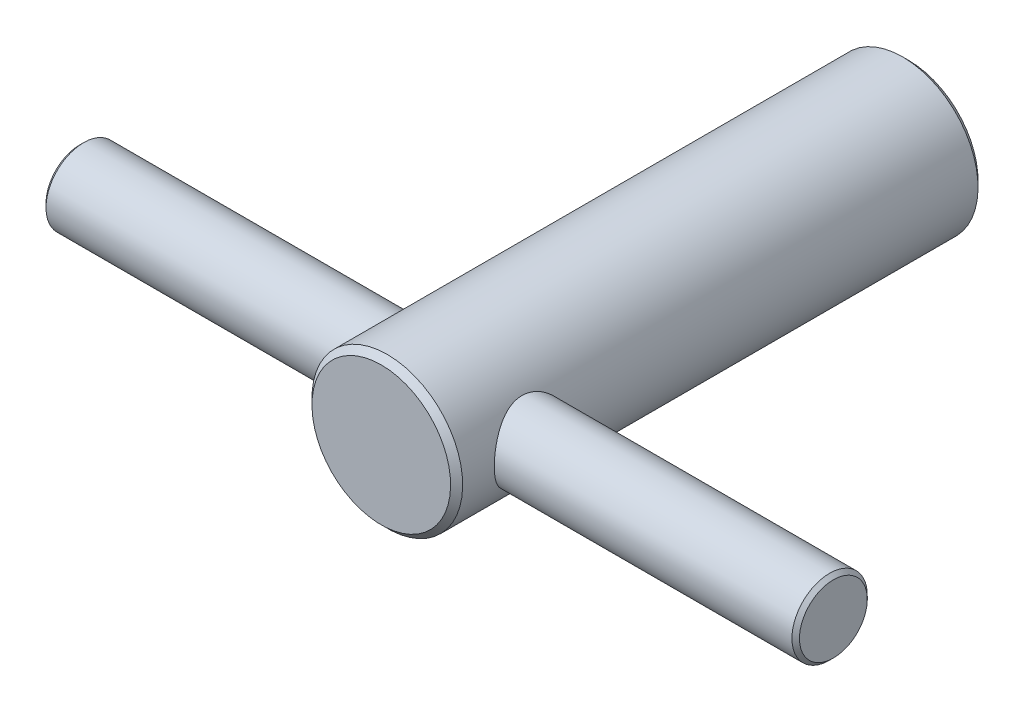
ISO-10303-21;
HEADER;
FILE_DESCRIPTION(('STEP AP214'),'2;1');
FILE_NAME('part.step','',(''),(''),'','','');
FILE_SCHEMA(('AUTOMOTIVE_DESIGN { 1 0 10303 214 1 1 1 1 }'));
ENDSEC;
DATA;
#1=APPLICATION_CONTEXT('core data for automotive mechanical design processes');
#2=APPLICATION_PROTOCOL_DEFINITION('international standard','automotive_design',2000,#1);
#3=PRODUCT_CONTEXT('',#1,'mechanical');
#4=PRODUCT('Part','Part','',(#3));
#5=PRODUCT_RELATED_PRODUCT_CATEGORY('part','',(#4));
#6=PRODUCT_DEFINITION_FORMATION('','',#4);
#7=PRODUCT_DEFINITION_CONTEXT('part definition',#1,'design');
#8=PRODUCT_DEFINITION('design','',#6,#7);
#9=PRODUCT_DEFINITION_SHAPE('','',#8);
#10=(LENGTH_UNIT() NAMED_UNIT(*) SI_UNIT(.MILLI.,.METRE.));
#11=(NAMED_UNIT(*) PLANE_ANGLE_UNIT() SI_UNIT($,.RADIAN.));
#12=(NAMED_UNIT(*) SI_UNIT($,.STERADIAN.) SOLID_ANGLE_UNIT());
#13=UNCERTAINTY_MEASURE_WITH_UNIT(LENGTH_MEASURE(1.E-05),#10,'distance_accuracy_value','');
#14=(GEOMETRIC_REPRESENTATION_CONTEXT(3) GLOBAL_UNCERTAINTY_ASSIGNED_CONTEXT((#13)) GLOBAL_UNIT_ASSIGNED_CONTEXT((#10,
#11,#12)) REPRESENTATION_CONTEXT('',''));
#15=CARTESIAN_POINT('',(0.,0.,0.));
#16=DIRECTION('',(0.,0.,1.));
#17=DIRECTION('',(1.,0.,0.));
#18=AXIS2_PLACEMENT_3D('',#15,#16,#17);
#19=CARTESIAN_POINT('',(0.,0.,0.));
#20=DIRECTION('',(0.,0.,-1.));
#21=DIRECTION('',(0.,1.,0.));
#22=AXIS2_PLACEMENT_3D('',#19,#20,#21);
#23=CYLINDRICAL_SURFACE('',#22,10.);
#24=CARTESIAN_POINT('',(0.,0.,0.8));
#25=DIRECTION('',(0.,0.,-1.));
#26=DIRECTION('',(0.,1.,0.));
#27=AXIS2_PLACEMENT_3D('',#24,#25,#26);
#28=CIRCLE('',#27,10.);
#29=CARTESIAN_POINT('',(0.,10.,0.8));
#30=VERTEX_POINT('',#29);
#31=EDGE_CURVE('E87',#30,#30,#28,.T.);
#32=ORIENTED_EDGE('',*,*,#31,.F.);
#33=EDGE_LOOP('',(#32));
#34=FACE_BOUND('',#33,.T.);
#35=CARTESIAN_POINT('',(8.66025403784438,5.,60.));
#36=CARTESIAN_POINT('',(8.66025482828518,4.99999937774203,60.1303316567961));
#37=CARTESIAN_POINT('',(8.66320639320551,4.99489703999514,60.2606749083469));
#38=CARTESIAN_POINT('',(8.67490215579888,4.97455590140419,60.5203552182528));
#39=CARTESIAN_POINT('',(8.68364905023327,4.95931238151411,60.6496917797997));
#40=CARTESIAN_POINT('',(8.70662912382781,4.91885673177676,60.9065135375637));
#41=CARTESIAN_POINT('',(8.72087090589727,4.89362896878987,61.033995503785));
#42=CARTESIAN_POINT('',(8.75432466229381,4.83352579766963,61.2860174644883));
#43=CARTESIAN_POINT('',(8.77353879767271,4.79864619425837,61.410556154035));
#44=CARTESIAN_POINT('',(8.83745677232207,4.68053466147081,61.7771112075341));
#45=CARTESIAN_POINT('',(8.88859880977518,4.58356144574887,62.0137323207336));
#46=CARTESIAN_POINT('',(9.00213659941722,4.35632594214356,62.4671619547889));
#47=CARTESIAN_POINT('',(9.06453296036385,4.22606185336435,62.6839694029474));
#48=CARTESIAN_POINT('',(9.19984032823,3.92334549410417,63.1115106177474));
#49=CARTESIAN_POINT('',(9.27319410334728,3.74829976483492,63.3202685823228));
#50=CARTESIAN_POINT('',(9.41860822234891,3.36622943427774,63.7070690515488));
#51=CARTESIAN_POINT('',(9.49066790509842,3.15918897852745,63.8850962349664));
#52=CARTESIAN_POINT('',(9.59484443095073,2.82033206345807,64.1312264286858));
#53=CARTESIAN_POINT('',(9.62993554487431,2.69838192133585,64.2119131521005));
#54=CARTESIAN_POINT('',(9.69680156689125,2.44722131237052,64.3626286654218));
#55=CARTESIAN_POINT('',(9.72857779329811,2.31801376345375,64.4326616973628));
#56=CARTESIAN_POINT('',(9.78789520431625,2.05317391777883,64.5613762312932));
#57=CARTESIAN_POINT('',(9.81543747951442,1.91754328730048,64.6200606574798));
#58=CARTESIAN_POINT('',(9.86547242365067,1.64079696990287,64.7254310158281));
#59=CARTESIAN_POINT('',(9.88796562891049,1.49968186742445,64.7721182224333));
#60=CARTESIAN_POINT('',(9.92580359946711,1.2233043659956,64.8500155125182));
#61=CARTESIAN_POINT('',(9.94154295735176,1.08833937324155,64.8820901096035));
#62=CARTESIAN_POINT('',(9.96761571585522,0.815709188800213,64.9349664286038));
#63=CARTESIAN_POINT('',(9.97794964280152,0.67804426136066,64.9557692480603));
#64=CARTESIAN_POINT('',(9.99290900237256,0.401217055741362,64.9858199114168));
#65=CARTESIAN_POINT('',(9.99753719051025,0.262055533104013,64.9950733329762));
#66=CARTESIAN_POINT('',(10.0009568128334,-0.0166220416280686,65.0019143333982));
#67=CARTESIAN_POINT('',(9.99974860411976,-0.156138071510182,64.9995026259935));
#68=CARTESIAN_POINT('',(9.99189263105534,-0.422158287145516,64.9837693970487));
#69=CARTESIAN_POINT('',(9.9857287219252,-0.548735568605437,64.9714182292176));
#70=CARTESIAN_POINT('',(9.9687211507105,-0.800312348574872,64.937167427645));
#71=CARTESIAN_POINT('',(9.95787601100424,-0.92531133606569,64.915264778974));
#72=CARTESIAN_POINT('',(9.93176736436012,-1.17280363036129,64.8621537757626));
#73=CARTESIAN_POINT('',(9.91650533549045,-1.29529776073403,64.8309485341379));
#74=CARTESIAN_POINT('',(9.88192155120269,-1.53706747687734,64.7595523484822));
#75=CARTESIAN_POINT('',(9.86259824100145,-1.6563418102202,64.7193579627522));
#76=CARTESIAN_POINT('',(9.79859222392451,-2.01140340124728,64.5846254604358));
#77=CARTESIAN_POINT('',(9.74822622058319,-2.24122720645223,64.4766310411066));
#78=CARTESIAN_POINT('',(9.63687815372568,-2.67992393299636,64.2286703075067));
#79=CARTESIAN_POINT('',(9.57589229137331,-2.88878931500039,64.088692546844));
#80=CARTESIAN_POINT('',(9.44222356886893,-3.30085071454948,63.7655365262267));
#81=CARTESIAN_POINT('',(9.36897995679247,-3.50164452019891,63.5795253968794));
#82=CARTESIAN_POINT('',(9.22270586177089,-3.87054772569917,63.1770108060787));
#83=CARTESIAN_POINT('',(9.14967558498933,-4.03863197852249,62.9604841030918));
#84=CARTESIAN_POINT('',(9.04390911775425,-4.26795395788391,62.6088064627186));
#85=CARTESIAN_POINT('',(9.00829977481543,-4.34240098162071,62.4829490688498));
#86=CARTESIAN_POINT('',(8.94051483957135,-4.48030007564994,62.2244861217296));
#87=CARTESIAN_POINT('',(8.90833780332,-4.54375677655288,62.0918834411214));
#88=CARTESIAN_POINT('',(8.84860631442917,-4.65901104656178,61.8207965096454));
#89=CARTESIAN_POINT('',(8.82104906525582,-4.71081567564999,61.6823158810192));
#90=CARTESIAN_POINT('',(8.7716484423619,-4.80217514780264,61.4003786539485));
#91=CARTESIAN_POINT('',(8.74980428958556,-4.84173166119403,61.2569227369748));
#92=CARTESIAN_POINT('',(8.71426171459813,-4.90539138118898,60.9777430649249));
#93=CARTESIAN_POINT('',(8.7000553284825,-4.93047005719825,60.8423062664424));
#94=CARTESIAN_POINT('',(8.67788216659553,-4.96939299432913,60.5693280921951));
#95=CARTESIAN_POINT('',(8.66991462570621,-4.98323863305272,60.4317869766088));
#96=CARTESIAN_POINT('',(8.66056020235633,-4.99947854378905,60.1558845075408));
#97=CARTESIAN_POINT('',(8.65916956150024,-5.0018793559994,60.01752366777));
#98=CARTESIAN_POINT('',(8.66301922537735,-4.99520900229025,59.7411790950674));
#99=CARTESIAN_POINT('',(8.66825908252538,-4.98613861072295,59.6031953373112));
#100=CARTESIAN_POINT('',(8.68421505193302,-4.9582892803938,59.3439119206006));
#101=CARTESIAN_POINT('',(8.69426699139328,-4.94068517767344,59.2224432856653));
#102=CARTESIAN_POINT('',(8.71910498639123,-4.8967167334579,58.9815824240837));
#103=CARTESIAN_POINT('',(8.73389250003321,-4.87034969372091,58.8621908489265));
#104=CARTESIAN_POINT('',(8.7846960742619,-4.77850297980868,58.5082899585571));
#105=CARTESIAN_POINT('',(8.82716454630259,-4.7002591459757,58.2778857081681));
#106=CARTESIAN_POINT('',(8.92681241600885,-4.50823244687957,57.8229067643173));
#107=CARTESIAN_POINT('',(8.98458205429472,-4.392971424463,57.5990963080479));
#108=CARTESIAN_POINT('',(9.10780608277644,-4.13143421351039,57.1726622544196));
#109=CARTESIAN_POINT('',(9.1732644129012,-3.9851420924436,56.9700496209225));
#110=CARTESIAN_POINT('',(9.31439795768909,-3.64419701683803,56.5651085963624));
#111=CARTESIAN_POINT('',(9.39032093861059,-3.44577250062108,56.3660355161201));
#112=CARTESIAN_POINT('',(9.53671997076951,-3.01697632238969,56.0029175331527));
#113=CARTESIAN_POINT('',(9.60719417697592,-2.78659391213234,55.8388844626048));
#114=CARTESIAN_POINT('',(9.70419418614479,-2.41774074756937,55.6209905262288));
#115=CARTESIAN_POINT('',(9.73542921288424,-2.28903769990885,55.5523379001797));
#116=CARTESIAN_POINT('',(9.79367711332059,-2.02535752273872,55.426243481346));
#117=CARTESIAN_POINT('',(9.82069185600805,-1.89038320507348,55.3687967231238));
#118=CARTESIAN_POINT('',(9.86968940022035,-1.61516754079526,55.2657820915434));
#119=CARTESIAN_POINT('',(9.89167460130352,-1.47492874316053,55.2202085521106));
#120=CARTESIAN_POINT('',(9.92995088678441,-1.19024723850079,55.1414909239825));
#121=CARTESIAN_POINT('',(9.94624264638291,-1.04580503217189,55.1083453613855));
#122=CARTESIAN_POINT('',(9.97139931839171,-0.767401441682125,55.0574049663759));
#123=CARTESIAN_POINT('',(9.98080865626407,-0.633694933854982,55.0384803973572));
#124=CARTESIAN_POINT('',(9.99424478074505,-0.364924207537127,55.0115065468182));
#125=CARTESIAN_POINT('',(9.9982719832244,-0.229860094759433,55.0034564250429));
#126=CARTESIAN_POINT('',(10.0008314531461,0.0404881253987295,54.9983368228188));
#127=CARTESIAN_POINT('',(9.999365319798,0.175772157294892,55.0012641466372));
#128=CARTESIAN_POINT('',(9.99098333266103,0.445485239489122,55.0180525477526));
#129=CARTESIAN_POINT('',(9.98406762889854,0.579914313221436,55.0319133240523));
#130=CARTESIAN_POINT('',(9.96560870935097,0.838004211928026,55.0691176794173));
#131=CARTESIAN_POINT('',(9.95440210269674,0.961788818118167,55.0917728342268));
#132=CARTESIAN_POINT('',(9.92767317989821,1.20687032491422,55.1462131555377));
#133=CARTESIAN_POINT('',(9.91214948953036,1.32816642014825,55.1780012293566));
#134=CARTESIAN_POINT('',(9.859612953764,1.68709586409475,55.2866082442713));
#135=CARTESIAN_POINT('',(9.81661817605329,1.91998814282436,55.3767019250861));
#136=CARTESIAN_POINT('',(9.71629432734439,2.37715486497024,55.5936422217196));
#137=CARTESIAN_POINT('',(9.65843082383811,2.60063468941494,55.7218959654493));
#138=CARTESIAN_POINT('',(9.53440669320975,3.02386422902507,56.0097903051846));
#139=CARTESIAN_POINT('',(9.46824226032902,3.22360297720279,56.1694453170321));
#140=CARTESIAN_POINT('',(9.32643278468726,3.61456788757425,56.5339751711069));
#141=CARTESIAN_POINT('',(9.25049954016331,3.80296860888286,56.7417690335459));
#142=CARTESIAN_POINT('',(9.10314421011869,4.14333626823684,57.1872970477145));
#143=CARTESIAN_POINT('',(9.03172615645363,4.29527097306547,57.4250574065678));
#144=CARTESIAN_POINT('',(8.93341291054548,4.49442606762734,57.8042196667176));
#145=CARTESIAN_POINT('',(8.90168698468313,4.55675683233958,57.936626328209));
#146=CARTESIAN_POINT('',(8.84287972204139,4.6698542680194,58.2072554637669));
#147=CARTESIAN_POINT('',(8.81579599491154,4.7206268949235,58.3454748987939));
#148=CARTESIAN_POINT('',(8.76742025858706,4.80987708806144,58.6264078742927));
#149=CARTESIAN_POINT('',(8.74611337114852,4.8483862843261,58.7691087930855));
#150=CARTESIAN_POINT('',(8.71014784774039,4.91270711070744,59.0580921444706));
#151=CARTESIAN_POINT('',(8.69548456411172,4.93852761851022,59.2043719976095));
#152=CARTESIAN_POINT('',(8.67647541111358,4.97182308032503,59.4589978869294));
#153=CARTESIAN_POINT('',(8.67040719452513,4.98237929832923,59.5668242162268));
#154=CARTESIAN_POINT('',(8.66229604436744,4.99646825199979,59.7830976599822));
#155=CARTESIAN_POINT('',(8.66025338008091,5.00000051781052,59.8915448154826));
#156=CARTESIAN_POINT('',(8.66025403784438,5.,60.));
#157=B_SPLINE_CURVE_WITH_KNOTS('',3,(#35,#36,#37,#38,#39,#40,#41,#42,#43,#44,#45,#46,#47,#48,
#49,#50,#51,#52,#53,#54,#55,#56,#57,#58,#59,#60,#61,#62,#63,#64,#65,#66,#67,#68,#69,#70,#71,#72,
#73,#74,#75,#76,#77,#78,#79,#80,#81,#82,#83,#84,#85,#86,#87,#88,#89,#90,#91,#92,#93,#94,#95,#96,
#97,#98,#99,#100,#101,#102,#103,#104,#105,#106,#107,#108,#109,#110,#111,#112,#113,#114,#115,
#116,#117,#118,#119,#120,#121,#122,#123,#124,#125,#126,#127,#128,#129,#130,#131,#132,#133,#134,
#135,#136,#137,#138,#139,#140,#141,#142,#143,#144,#145,#146,#147,#148,#149,#150,#151,#152,#153,
#154,#155,#156),.UNSPECIFIED.,.T.,.F.,(4,2,2,2,2,2,2,2,2,2,2,2,2,2,2,2,2,2,2,2,2,2,2,2,2,2,2,2,
2,2,2,2,2,2,2,2,2,2,2,2,2,2,2,2,2,2,2,2,2,2,2,2,2,2,2,2,2,2,2,2,4),(0.,0.390882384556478,
0.781946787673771,1.17362595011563,1.56547562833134,2.34415414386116,3.12287479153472,
3.96582272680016,4.80918971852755,5.25982992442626,5.71029022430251,6.16063429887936,
6.61093051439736,7.02920538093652,7.44743951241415,7.86547158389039,8.28347807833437,
8.66500933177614,9.0466611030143,9.42818530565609,9.80985583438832,10.5829669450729,
11.3563551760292,12.2028497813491,13.0499926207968,13.501002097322,13.9518210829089,
14.4023661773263,14.8528498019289,15.2676702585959,15.6824398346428,16.0969723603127,
16.5114769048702,16.8804871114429,17.2496110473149,17.9873544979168,18.759266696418,
19.5315761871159,20.4012390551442,21.2711951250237,21.7182117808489,22.1650299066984,
22.6116344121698,23.0581859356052,23.4637505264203,23.8692837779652,24.2746989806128,
24.6801030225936,25.0586722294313,25.4373620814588,26.1940875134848,26.9831783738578,
27.7726323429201,28.6406529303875,29.5094379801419,29.9581473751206,30.4066250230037,
30.8539364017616,31.3009343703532,31.626184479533,31.9514563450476),.UNSPECIFIED.);
#158=CARTESIAN_POINT('',(8.66025403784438,5.,60.));
#159=VERTEX_POINT('',#158);
#160=EDGE_CURVE('E27',#159,#159,#157,.T.);
#161=ORIENTED_EDGE('',*,*,#160,.F.);
#162=EDGE_LOOP('',(#161));
#163=FACE_BOUND('',#162,.T.);
#164=CARTESIAN_POINT('',(0.,0.,69.2));
#165=DIRECTION('',(0.,0.,-1.));
#166=DIRECTION('',(0.,1.,0.));
#167=AXIS2_PLACEMENT_3D('',#164,#165,#166);
#168=CIRCLE('',#167,10.);
#169=CARTESIAN_POINT('',(0.,10.,69.2));
#170=VERTEX_POINT('',#169);
#171=EDGE_CURVE('E94',#170,#170,#168,.T.);
#172=ORIENTED_EDGE('',*,*,#171,.T.);
#173=EDGE_LOOP('',(#172));
#174=FACE_BOUND('',#173,.T.);
#175=CARTESIAN_POINT('',(-8.66025403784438,5.,60.));
#176=CARTESIAN_POINT('',(-8.66025482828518,4.99999937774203,59.8696683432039));
#177=CARTESIAN_POINT('',(-8.66320639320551,4.99489703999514,59.7393250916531));
#178=CARTESIAN_POINT('',(-8.67490215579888,4.97455590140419,59.4796447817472));
#179=CARTESIAN_POINT('',(-8.68364905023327,4.95931238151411,59.3503082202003));
#180=CARTESIAN_POINT('',(-8.70662912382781,4.91885673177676,59.0934864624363));
#181=CARTESIAN_POINT('',(-8.72087090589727,4.89362896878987,58.966004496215));
#182=CARTESIAN_POINT('',(-8.75432466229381,4.83352579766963,58.7139825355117));
#183=CARTESIAN_POINT('',(-8.77353879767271,4.79864619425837,58.589443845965));
#184=CARTESIAN_POINT('',(-8.83745677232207,4.68053466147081,58.2228887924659));
#185=CARTESIAN_POINT('',(-8.88859880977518,4.58356144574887,57.9862676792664));
#186=CARTESIAN_POINT('',(-9.00213659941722,4.35632594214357,57.5328380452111));
#187=CARTESIAN_POINT('',(-9.06453296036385,4.22606185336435,57.3160305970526));
#188=CARTESIAN_POINT('',(-9.19984032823,3.92334549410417,56.8884893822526));
#189=CARTESIAN_POINT('',(-9.27319410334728,3.74829976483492,56.6797314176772));
#190=CARTESIAN_POINT('',(-9.41860822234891,3.36622943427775,56.2929309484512));
#191=CARTESIAN_POINT('',(-9.49066790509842,3.15918897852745,56.1149037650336));
#192=CARTESIAN_POINT('',(-9.59484443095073,2.82033206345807,55.8687735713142));
#193=CARTESIAN_POINT('',(-9.62993554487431,2.69838192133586,55.7880868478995));
#194=CARTESIAN_POINT('',(-9.69680156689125,2.44722131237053,55.6373713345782));
#195=CARTESIAN_POINT('',(-9.72857779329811,2.31801376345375,55.5673383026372));
#196=CARTESIAN_POINT('',(-9.78789520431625,2.05317391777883,55.4386237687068));
#197=CARTESIAN_POINT('',(-9.81543747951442,1.91754328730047,55.3799393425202));
#198=CARTESIAN_POINT('',(-9.86547242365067,1.64079696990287,55.2745689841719));
#199=CARTESIAN_POINT('',(-9.88796562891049,1.49968186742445,55.2278817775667));
#200=CARTESIAN_POINT('',(-9.92580359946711,1.2233043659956,55.1499844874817));
#201=CARTESIAN_POINT('',(-9.94154295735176,1.08833937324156,55.1179098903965));
#202=CARTESIAN_POINT('',(-9.96761571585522,0.815709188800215,55.0650335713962));
#203=CARTESIAN_POINT('',(-9.97794964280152,0.678044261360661,55.0442307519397));
#204=CARTESIAN_POINT('',(-9.99290900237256,0.401217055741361,55.0141800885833));
#205=CARTESIAN_POINT('',(-9.99753719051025,0.262055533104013,55.0049266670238));
#206=CARTESIAN_POINT('',(-10.0009568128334,-0.0166220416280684,54.9980856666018));
#207=CARTESIAN_POINT('',(-9.99974860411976,-0.156138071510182,55.0004973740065));
#208=CARTESIAN_POINT('',(-9.99189263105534,-0.422158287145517,55.0162306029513));
#209=CARTESIAN_POINT('',(-9.9857287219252,-0.548735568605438,55.0285817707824));
#210=CARTESIAN_POINT('',(-9.9687211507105,-0.800312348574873,55.0628325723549));
#211=CARTESIAN_POINT('',(-9.95787601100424,-0.925311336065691,55.084735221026));
#212=CARTESIAN_POINT('',(-9.93176736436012,-1.17280363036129,55.1378462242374));
#213=CARTESIAN_POINT('',(-9.91650533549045,-1.29529776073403,55.1690514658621));
#214=CARTESIAN_POINT('',(-9.88192155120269,-1.53706747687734,55.2404476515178));
#215=CARTESIAN_POINT('',(-9.86259824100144,-1.6563418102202,55.2806420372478));
#216=CARTESIAN_POINT('',(-9.79859222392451,-2.01140340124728,55.4153745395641));
#217=CARTESIAN_POINT('',(-9.74822622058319,-2.24122720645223,55.5233689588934));
#218=CARTESIAN_POINT('',(-9.63687815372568,-2.67992393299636,55.7713296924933));
#219=CARTESIAN_POINT('',(-9.57589229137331,-2.88878931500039,55.911307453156));
#220=CARTESIAN_POINT('',(-9.44222356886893,-3.30085071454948,56.2344634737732));
#221=CARTESIAN_POINT('',(-9.36897995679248,-3.50164452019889,56.4204746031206));
#222=CARTESIAN_POINT('',(-9.22270586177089,-3.87054772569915,56.8229891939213));
#223=CARTESIAN_POINT('',(-9.14967558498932,-4.03863197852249,57.0395158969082));
#224=CARTESIAN_POINT('',(-9.04390911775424,-4.26795395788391,57.3911935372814));
#225=CARTESIAN_POINT('',(-9.00829977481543,-4.34240098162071,57.5170509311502));
#226=CARTESIAN_POINT('',(-8.94051483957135,-4.48030007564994,57.7755138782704));
#227=CARTESIAN_POINT('',(-8.90833780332,-4.54375677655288,57.9081165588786));
#228=CARTESIAN_POINT('',(-8.84860631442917,-4.65901104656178,58.1792034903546));
#229=CARTESIAN_POINT('',(-8.82104906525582,-4.71081567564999,58.3176841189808));
#230=CARTESIAN_POINT('',(-8.7716484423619,-4.80217514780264,58.5996213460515));
#231=CARTESIAN_POINT('',(-8.74980428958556,-4.84173166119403,58.7430772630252));
#232=CARTESIAN_POINT('',(-8.71426171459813,-4.90539138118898,59.0222569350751));
#233=CARTESIAN_POINT('',(-8.7000553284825,-4.93047005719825,59.1576937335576));
#234=CARTESIAN_POINT('',(-8.67788216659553,-4.96939299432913,59.4306719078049));
#235=CARTESIAN_POINT('',(-8.66991462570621,-4.98323863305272,59.5682130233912));
#236=CARTESIAN_POINT('',(-8.66056020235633,-4.99947854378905,59.8441154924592));
#237=CARTESIAN_POINT('',(-8.65916956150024,-5.0018793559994,59.98247633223));
#238=CARTESIAN_POINT('',(-8.66301922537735,-4.99520900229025,60.2588209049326));
#239=CARTESIAN_POINT('',(-8.66825908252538,-4.98613861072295,60.3968046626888));
#240=CARTESIAN_POINT('',(-8.68421505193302,-4.9582892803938,60.6560880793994));
#241=CARTESIAN_POINT('',(-8.69426699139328,-4.94068517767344,60.7775567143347));
#242=CARTESIAN_POINT('',(-8.71910498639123,-4.8967167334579,61.0184175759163));
#243=CARTESIAN_POINT('',(-8.73389250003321,-4.87034969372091,61.1378091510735));
#244=CARTESIAN_POINT('',(-8.7846960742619,-4.77850297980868,61.4917100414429));
#245=CARTESIAN_POINT('',(-8.82716454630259,-4.70025914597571,61.7221142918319));
#246=CARTESIAN_POINT('',(-8.92681241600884,-4.50823244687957,62.1770932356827));
#247=CARTESIAN_POINT('',(-8.98458205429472,-4.392971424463,62.4009036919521));
#248=CARTESIAN_POINT('',(-9.10780608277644,-4.13143421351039,62.8273377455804));
#249=CARTESIAN_POINT('',(-9.1732644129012,-3.9851420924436,63.0299503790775));
#250=CARTESIAN_POINT('',(-9.31439795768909,-3.64419701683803,63.4348914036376));
#251=CARTESIAN_POINT('',(-9.39032093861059,-3.44577250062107,63.6339644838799));
#252=CARTESIAN_POINT('',(-9.53671997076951,-3.01697632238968,63.9970824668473));
#253=CARTESIAN_POINT('',(-9.60719417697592,-2.78659391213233,64.1611155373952));
#254=CARTESIAN_POINT('',(-9.70419418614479,-2.41774074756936,64.3790094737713));
#255=CARTESIAN_POINT('',(-9.73542921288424,-2.28903769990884,64.4476620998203));
#256=CARTESIAN_POINT('',(-9.79367711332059,-2.02535752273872,64.5737565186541));
#257=CARTESIAN_POINT('',(-9.82069185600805,-1.89038320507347,64.6312032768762));
#258=CARTESIAN_POINT('',(-9.86968940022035,-1.61516754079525,64.7342179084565));
#259=CARTESIAN_POINT('',(-9.89167460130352,-1.47492874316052,64.7797914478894));
#260=CARTESIAN_POINT('',(-9.92995088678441,-1.19024723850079,64.8585090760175));
#261=CARTESIAN_POINT('',(-9.94624264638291,-1.04580503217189,64.8916546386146));
#262=CARTESIAN_POINT('',(-9.97139931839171,-0.767401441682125,64.9425950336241));
#263=CARTESIAN_POINT('',(-9.98080865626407,-0.633694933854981,64.9615196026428));
#264=CARTESIAN_POINT('',(-9.99424478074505,-0.364924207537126,64.9884934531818));
#265=CARTESIAN_POINT('',(-9.9982719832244,-0.229860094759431,64.9965435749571));
#266=CARTESIAN_POINT('',(-10.0008314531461,0.0404881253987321,65.0016631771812));
#267=CARTESIAN_POINT('',(-9.999365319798,0.175772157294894,64.9987358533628));
#268=CARTESIAN_POINT('',(-9.99098333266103,0.445485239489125,64.9819474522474));
#269=CARTESIAN_POINT('',(-9.98406762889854,0.57991431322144,64.9680866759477));
#270=CARTESIAN_POINT('',(-9.96560870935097,0.83800421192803,64.9308823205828));
#271=CARTESIAN_POINT('',(-9.95440210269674,0.961788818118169,64.9082271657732));
#272=CARTESIAN_POINT('',(-9.92767317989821,1.20687032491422,64.8537868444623));
#273=CARTESIAN_POINT('',(-9.91214948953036,1.32816642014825,64.8219987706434));
#274=CARTESIAN_POINT('',(-9.859612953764,1.68709586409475,64.7133917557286));
#275=CARTESIAN_POINT('',(-9.8166181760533,1.91998814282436,64.6232980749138));
#276=CARTESIAN_POINT('',(-9.71629432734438,2.37715486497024,64.4063577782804));
#277=CARTESIAN_POINT('',(-9.65843082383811,2.60063468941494,64.2781040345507));
#278=CARTESIAN_POINT('',(-9.53440669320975,3.02386422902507,63.9902096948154));
#279=CARTESIAN_POINT('',(-9.46824226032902,3.22360297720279,63.8305546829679));
#280=CARTESIAN_POINT('',(-9.32643278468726,3.61456788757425,63.4660248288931));
#281=CARTESIAN_POINT('',(-9.25049954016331,3.80296860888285,63.2582309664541));
#282=CARTESIAN_POINT('',(-9.10314421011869,4.14333626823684,62.8127029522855));
#283=CARTESIAN_POINT('',(-9.03172615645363,4.29527097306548,62.5749425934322));
#284=CARTESIAN_POINT('',(-8.93341291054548,4.49442606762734,62.1957803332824));
#285=CARTESIAN_POINT('',(-8.90168698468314,4.55675683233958,62.063373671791));
#286=CARTESIAN_POINT('',(-8.8428797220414,4.66985426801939,61.7927445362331));
#287=CARTESIAN_POINT('',(-8.81579599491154,4.72062689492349,61.6545251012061));
#288=CARTESIAN_POINT('',(-8.76742025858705,4.80987708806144,61.3735921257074));
#289=CARTESIAN_POINT('',(-8.74611337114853,4.8483862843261,61.2308912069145));
#290=CARTESIAN_POINT('',(-8.71014784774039,4.91270711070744,60.9419078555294));
#291=CARTESIAN_POINT('',(-8.69548456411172,4.93852761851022,60.7956280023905));
#292=CARTESIAN_POINT('',(-8.67647541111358,4.97182308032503,60.5410021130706));
#293=CARTESIAN_POINT('',(-8.67040719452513,4.98237929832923,60.4331757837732));
#294=CARTESIAN_POINT('',(-8.66229604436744,4.99646825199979,60.2169023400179));
#295=CARTESIAN_POINT('',(-8.66025338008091,5.00000051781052,60.1084551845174));
#296=CARTESIAN_POINT('',(-8.66025403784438,5.,60.));
#297=B_SPLINE_CURVE_WITH_KNOTS('',3,(#175,#176,#177,#178,#179,#180,#181,#182,#183,#184,#185,
#186,#187,#188,#189,#190,#191,#192,#193,#194,#195,#196,#197,#198,#199,#200,#201,#202,#203,#204,
#205,#206,#207,#208,#209,#210,#211,#212,#213,#214,#215,#216,#217,#218,#219,#220,#221,#222,#223,
#224,#225,#226,#227,#228,#229,#230,#231,#232,#233,#234,#235,#236,#237,#238,#239,#240,#241,#242,
#243,#244,#245,#246,#247,#248,#249,#250,#251,#252,#253,#254,#255,#256,#257,#258,#259,#260,#261,
#262,#263,#264,#265,#266,#267,#268,#269,#270,#271,#272,#273,#274,#275,#276,#277,#278,#279,#280,
#281,#282,#283,#284,#285,#286,#287,#288,#289,#290,#291,#292,#293,#294,#295,#296),.UNSPECIFIED.,
.T.,.F.,(4,2,2,2,2,2,2,2,2,2,2,2,2,2,2,2,2,2,2,2,2,2,2,2,2,2,2,2,2,2,2,2,2,2,2,2,2,2,2,2,2,2,2,
2,2,2,2,2,2,2,2,2,2,2,2,2,2,2,2,2,4),(0.,0.390882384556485,0.781946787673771,1.17362595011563,
1.56547562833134,2.34415414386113,3.12287479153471,3.96582272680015,4.80918971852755,
5.25982992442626,5.71029022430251,6.16063429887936,6.61093051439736,7.02920538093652,
7.44743951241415,7.86547158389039,8.28347807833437,8.66500933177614,9.0466611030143,
9.42818530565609,9.80985583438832,10.5829669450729,11.3563551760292,12.202849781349,
13.0499926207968,13.501002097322,13.9518210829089,14.4023661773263,14.8528498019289,
15.2676702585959,15.6824398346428,16.0969723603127,16.5114769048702,16.8804871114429,
17.2496110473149,17.9873544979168,18.759266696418,19.5315761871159,20.4012390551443,
21.2711951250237,21.7182117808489,22.1650299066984,22.6116344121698,23.0581859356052,
23.4637505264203,23.8692837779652,24.2746989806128,24.6801030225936,25.0586722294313,
25.4373620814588,26.1940875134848,26.9831783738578,27.7726323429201,28.6406529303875,
29.5094379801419,29.9581473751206,30.4066250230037,30.8539364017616,31.3009343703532,
31.626184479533,31.9514563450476),.UNSPECIFIED.);
#298=CARTESIAN_POINT('',(-8.66025403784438,5.,60.));
#299=VERTEX_POINT('',#298);
#300=EDGE_CURVE('E23',#299,#299,#297,.T.);
#301=ORIENTED_EDGE('',*,*,#300,.F.);
#302=EDGE_LOOP('',(#301));
#303=FACE_BOUND('',#302,.T.);
#304=ADVANCED_FACE('F12',(#34,#163,#174,#303),#23,.T.);
#305=CARTESIAN_POINT('',(9.2,0.,0.));
#306=DIRECTION('',(0.,0.,1.));
#307=DIRECTION('',(0.,-1.,0.));
#308=AXIS2_PLACEMENT_3D('',#305,#306,#307);
#309=PLANE('',#308);
#310=CARTESIAN_POINT('',(0.,0.,0.));
#311=DIRECTION('',(0.,0.,1.));
#312=DIRECTION('',(0.,-1.,0.));
#313=AXIS2_PLACEMENT_3D('',#310,#311,#312);
#314=CIRCLE('',#313,7.);
#315=CARTESIAN_POINT('',(0.,-7.,0.));
#316=VERTEX_POINT('',#315);
#317=EDGE_CURVE('E8',#316,#316,#314,.T.);
#318=ORIENTED_EDGE('',*,*,#317,.T.);
#319=EDGE_LOOP('',(#318));
#320=FACE_BOUND('',#319,.T.);
#321=CARTESIAN_POINT('',(0.,0.,0.));
#322=DIRECTION('',(0.,0.,-1.));
#323=DIRECTION('',(0.,1.,0.));
#324=AXIS2_PLACEMENT_3D('',#321,#322,#323);
#325=CIRCLE('',#324,9.2);
#326=CARTESIAN_POINT('',(0.,9.2,0.));
#327=VERTEX_POINT('',#326);
#328=EDGE_CURVE('E104',#327,#327,#325,.T.);
#329=ORIENTED_EDGE('',*,*,#328,.T.);
#330=EDGE_LOOP('',(#329));
#331=FACE_BOUND('',#330,.T.);
#332=ADVANCED_FACE('F61',(#320,#331),#309,.F.);
#333=CARTESIAN_POINT('',(0.,0.,70.));
#334=DIRECTION('',(0.,0.,-1.));
#335=DIRECTION('',(0.,1.,0.));
#336=AXIS2_PLACEMENT_3D('',#333,#334,#335);
#337=PLANE('',#336);
#338=CARTESIAN_POINT('',(0.,0.,70.));
#339=DIRECTION('',(0.,0.,-1.));
#340=DIRECTION('',(0.,1.,0.));
#341=AXIS2_PLACEMENT_3D('',#338,#339,#340);
#342=CIRCLE('',#341,9.2);
#343=CARTESIAN_POINT('',(0.,9.2,70.));
#344=VERTEX_POINT('',#343);
#345=EDGE_CURVE('E114',#344,#344,#342,.T.);
#346=ORIENTED_EDGE('',*,*,#345,.F.);
#347=EDGE_LOOP('',(#346));
#348=FACE_BOUND('',#347,.T.);
#349=ADVANCED_FACE('F63',(#348),#337,.F.);
#350=CARTESIAN_POINT('',(0.,0.,70.));
#351=DIRECTION('',(0.,0.,-1.));
#352=DIRECTION('',(0.,1.,0.));
#353=AXIS2_PLACEMENT_3D('',#350,#351,#352);
#354=CONICAL_SURFACE('',#353,9.2,0.785398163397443);
#355=ORIENTED_EDGE('',*,*,#171,.F.);
#356=EDGE_LOOP('',(#355));
#357=FACE_BOUND('',#356,.T.);
#358=ORIENTED_EDGE('',*,*,#345,.T.);
#359=EDGE_LOOP('',(#358));
#360=FACE_BOUND('',#359,.T.);
#361=ADVANCED_FACE('F67',(#357,#360),#354,.T.);
#362=CARTESIAN_POINT('',(0.,0.,0.8));
#363=DIRECTION('',(0.,0.,1.));
#364=DIRECTION('',(0.,-1.,0.));
#365=AXIS2_PLACEMENT_3D('',#362,#363,#364);
#366=CONICAL_SURFACE('',#365,10.,0.785398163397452);
#367=ORIENTED_EDGE('',*,*,#328,.F.);
#368=EDGE_LOOP('',(#367));
#369=FACE_BOUND('',#368,.T.);
#370=ORIENTED_EDGE('',*,*,#31,.T.);
#371=EDGE_LOOP('',(#370));
#372=FACE_BOUND('',#371,.T.);
#373=ADVANCED_FACE('F64',(#369,#372),#366,.T.);
#374=CARTESIAN_POINT('',(50.,0.,64.5));
#375=DIRECTION('',(-1.,0.,0.));
#376=DIRECTION('',(0.,-1.,0.));
#377=AXIS2_PLACEMENT_3D('',#374,#375,#376);
#378=PLANE('',#377);
#379=CARTESIAN_POINT('',(50.,0.,60.));
#380=DIRECTION('',(1.,0.,0.));
#381=DIRECTION('',(0.,1.,0.));
#382=AXIS2_PLACEMENT_3D('',#379,#380,#381);
#383=CIRCLE('',#382,4.5);
#384=CARTESIAN_POINT('',(50.,4.5,60.));
#385=VERTEX_POINT('',#384);
#386=EDGE_CURVE('E107',#385,#385,#383,.T.);
#387=ORIENTED_EDGE('',*,*,#386,.T.);
#388=EDGE_LOOP('',(#387));
#389=FACE_BOUND('',#388,.T.);
#390=ADVANCED_FACE('F66',(#389),#378,.F.);
#391=CARTESIAN_POINT('',(49.5,0.,60.));
#392=DIRECTION('',(-1.,0.,0.));
#393=DIRECTION('',(0.,-1.,0.));
#394=AXIS2_PLACEMENT_3D('',#391,#392,#393);
#395=CONICAL_SURFACE('',#394,5.,0.785398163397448);
#396=ORIENTED_EDGE('',*,*,#386,.F.);
#397=EDGE_LOOP('',(#396));
#398=FACE_BOUND('',#397,.T.);
#399=CARTESIAN_POINT('',(49.5,0.,60.));
#400=DIRECTION('',(1.,0.,0.));
#401=DIRECTION('',(0.,1.,0.));
#402=AXIS2_PLACEMENT_3D('',#399,#400,#401);
#403=CIRCLE('',#402,5.);
#404=CARTESIAN_POINT('',(49.5,5.,60.));
#405=VERTEX_POINT('',#404);
#406=EDGE_CURVE('E101',#405,#405,#403,.T.);
#407=ORIENTED_EDGE('',*,*,#406,.T.);
#408=EDGE_LOOP('',(#407));
#409=FACE_BOUND('',#408,.T.);
#410=ADVANCED_FACE('F50',(#398,#409),#395,.T.);
#411=CARTESIAN_POINT('',(50.,0.,60.));
#412=DIRECTION('',(1.,0.,0.));
#413=DIRECTION('',(0.,1.,0.));
#414=AXIS2_PLACEMENT_3D('',#411,#412,#413);
#415=CYLINDRICAL_SURFACE('',#414,5.);
#416=ORIENTED_EDGE('',*,*,#406,.F.);
#417=EDGE_LOOP('',(#416));
#418=FACE_BOUND('',#417,.T.);
#419=ORIENTED_EDGE('',*,*,#160,.T.);
#420=EDGE_LOOP('',(#419));
#421=FACE_BOUND('',#420,.T.);
#422=ADVANCED_FACE('F48',(#418,#421),#415,.T.);
#423=ORIENTED_EDGE('',*,*,#300,.T.);
#424=EDGE_LOOP('',(#423));
#425=FACE_BOUND('',#424,.T.);
#426=CARTESIAN_POINT('',(-49.5,0.,60.));
#427=DIRECTION('',(1.,0.,0.));
#428=DIRECTION('',(0.,1.,0.));
#429=AXIS2_PLACEMENT_3D('',#426,#427,#428);
#430=CIRCLE('',#429,5.);
#431=CARTESIAN_POINT('',(-49.5,5.,60.));
#432=VERTEX_POINT('',#431);
#433=EDGE_CURVE('E99',#432,#432,#430,.T.);
#434=ORIENTED_EDGE('',*,*,#433,.T.);
#435=EDGE_LOOP('',(#434));
#436=FACE_BOUND('',#435,.T.);
#437=ADVANCED_FACE('F42',(#425,#436),#415,.T.);
#438=CARTESIAN_POINT('',(-50.,0.,60.));
#439=DIRECTION('',(1.,0.,0.));
#440=DIRECTION('',(0.,1.,0.));
#441=AXIS2_PLACEMENT_3D('',#438,#439,#440);
#442=PLANE('',#441);
#443=CARTESIAN_POINT('',(-50.,0.,60.));
#444=DIRECTION('',(1.,0.,0.));
#445=DIRECTION('',(0.,1.,0.));
#446=AXIS2_PLACEMENT_3D('',#443,#444,#445);
#447=CIRCLE('',#446,4.5);
#448=CARTESIAN_POINT('',(-50.,4.5,60.));
#449=VERTEX_POINT('',#448);
#450=EDGE_CURVE('E100',#449,#449,#447,.T.);
#451=ORIENTED_EDGE('',*,*,#450,.F.);
#452=EDGE_LOOP('',(#451));
#453=FACE_BOUND('',#452,.T.);
#454=ADVANCED_FACE('F47',(#453),#442,.F.);
#455=CARTESIAN_POINT('',(-50.,0.,60.));
#456=DIRECTION('',(1.,0.,0.));
#457=DIRECTION('',(0.,1.,0.));
#458=AXIS2_PLACEMENT_3D('',#455,#456,#457);
#459=CONICAL_SURFACE('',#458,4.5,0.785398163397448);
#460=ORIENTED_EDGE('',*,*,#433,.F.);
#461=EDGE_LOOP('',(#460));
#462=FACE_BOUND('',#461,.T.);
#463=ORIENTED_EDGE('',*,*,#450,.T.);
#464=EDGE_LOOP('',(#463));
#465=FACE_BOUND('',#464,.T.);
#466=ADVANCED_FACE('F52',(#462,#465),#459,.T.);
#467=CARTESIAN_POINT('',(0.,0.,25.));
#468=DIRECTION('',(0.,0.,-1.));
#469=DIRECTION('',(0.,1.,0.));
#470=AXIS2_PLACEMENT_3D('',#467,#468,#469);
#471=CYLINDRICAL_SURFACE('',#470,6.);
#472=CARTESIAN_POINT('',(0.,0.,1.00000000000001));
#473=DIRECTION('',(0.,0.,1.));
#474=DIRECTION('',(0.,-1.,0.));
#475=AXIS2_PLACEMENT_3D('',#472,#473,#474);
#476=CIRCLE('',#475,6.);
#477=CARTESIAN_POINT('',(0.,-6.,1.00000000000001));
#478=VERTEX_POINT('',#477);
#479=EDGE_CURVE('E19',#478,#478,#476,.F.);
#480=ORIENTED_EDGE('',*,*,#479,.T.);
#481=EDGE_LOOP('',(#480));
#482=FACE_BOUND('',#481,.T.);
#483=CARTESIAN_POINT('',(0.,0.,25.));
#484=DIRECTION('',(0.,0.,-1.));
#485=DIRECTION('',(0.,1.,0.));
#486=AXIS2_PLACEMENT_3D('',#483,#484,#485);
#487=CIRCLE('',#486,6.);
#488=CARTESIAN_POINT('',(0.,6.,25.));
#489=VERTEX_POINT('',#488);
#490=EDGE_CURVE('E133',#489,#489,#487,.T.);
#491=ORIENTED_EDGE('',*,*,#490,.F.);
#492=EDGE_LOOP('',(#491));
#493=FACE_BOUND('',#492,.T.);
#494=ADVANCED_FACE('F56',(#482,#493),#471,.F.);
#495=CARTESIAN_POINT('',(0.,0.,25.));
#496=DIRECTION('',(0.,0.,-1.));
#497=DIRECTION('',(0.,1.,0.));
#498=AXIS2_PLACEMENT_3D('',#495,#496,#497);
#499=PLANE('',#498);
#500=ORIENTED_EDGE('',*,*,#490,.T.);
#501=EDGE_LOOP('',(#500));
#502=FACE_BOUND('',#501,.T.);
#503=ADVANCED_FACE('F138',(#502),#499,.T.);
#504=CARTESIAN_POINT('',(0.,0.,1.00000000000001));
#505=DIRECTION('',(0.,0.,-1.));
#506=DIRECTION('',(0.,1.,0.));
#507=AXIS2_PLACEMENT_3D('',#504,#505,#506);
#508=CONICAL_SURFACE('',#507,6.,0.78539816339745);
#509=ORIENTED_EDGE('',*,*,#317,.F.);
#510=EDGE_LOOP('',(#509));
#511=FACE_BOUND('',#510,.T.);
#512=ORIENTED_EDGE('',*,*,#479,.F.);
#513=EDGE_LOOP('',(#512));
#514=FACE_BOUND('',#513,.T.);
#515=ADVANCED_FACE('F14',(#511,#514),#508,.F.);
#516=CLOSED_SHELL('',(#304,#332,#349,#361,#373,#390,#410,#422,#437,#454,#466,#494,#503,#515));
#517=MANIFOLD_SOLID_BREP('B1',#516);
#518=ADVANCED_BREP_SHAPE_REPRESENTATION('',(#18,#517),#14);
#519=SHAPE_DEFINITION_REPRESENTATION(#9,#518);
ENDSEC;
END-ISO-10303-21;
